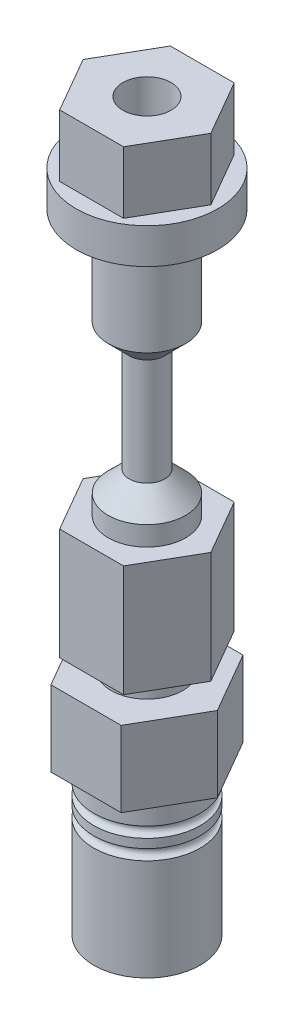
from build123d import *

# Parameters (mm, degrees)
BOSS_EXTRUDE1_DEPTH = 8.89
BOSS_EXTRUDE3_DEPTH = 16.002
BOSS_EXTRUDE4_DEPTH = 10.8458


with BuildPart() as part:
    # Sketch2 → Boss-Extrude1 (new body)
    with BuildSketch(Plane(origin=(0, 0, 0), x_dir=(1, 0, 0), z_dir=(0, 1, 0))):
        Polygon((4.582717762, 7.9375), (-4.582717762, 7.9375), (-9.165435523, 0), (-4.582717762, -7.9375), (4.582717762, -7.9375), (9.165435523, 0), align=None)
    extrude(amount=BOSS_EXTRUDE1_DEPTH)


with BuildPart() as body_2:
    # Sketch3 → Revolve1 (revolve)
    with BuildSketch(Plane.XY, mode=Mode.PRIVATE) as revolve1_sk:
        Polygon((-2.54, -22.06625), (-2.54, -37.36975), (-5.55625, -40.386), (-5.55625, -53.086), (0, -53.086), (0, 0), (-10.16, 0), (-10.16, -5.08), (-4.62661, -5.08), (-4.62661, -7.1628), (-5.55625, -7.1628), (-5.55625, -19.05), align=None)
    revolve(revolve1_sk.sketch.rotate(Axis((0, 0, 0), (0, -1, 0)), 270), axis=Axis((0, 0, 0), (0, -1, 0)))


with BuildPart() as body_3:
    # Sketch5 → Boss-Extrude3 (new body)
    with BuildSketch(Plane.XZ.offset(43.18)):
        Polygon((4.582717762, 7.9375), (-4.582717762, 7.9375), (-9.165435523, 0), (-4.582717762, -7.9375), (4.582717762, -7.9375), (9.165435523, 0), align=None)
    extrude(amount=BOSS_EXTRUDE3_DEPTH)

    # Sketch7 → Revolve2 (revolve)
    with BuildSketch(Plane.XY, mode=Mode.PRIVATE) as revolve2_sk:
        Polygon((-4.809515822, -51.630063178), (-5.1435, -62.357), (0, -62.357), (0, -51.630063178), align=None)
    revolve(revolve2_sk.sketch.rotate(Axis((0, -59.182, 0), (0, -1, 0)), 90), axis=Axis((0, -59.182, 0), (0, -1, 0)))

    # Sketch8 → Boss-Extrude4 (add)
    with BuildSketch(Plane.XZ.offset(62.357)):
        Polygon((5.044655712, 8.7376), (-5.044655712, 8.7376), (-10.089311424, 0), (-5.044655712, -8.7376), (5.044655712, -8.7376), (10.089311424, 0), align=None)
    extrude(amount=BOSS_EXTRUDE4_DEPTH)

    # Sketch9 → Revolve3 (revolve)
    with BuildSketch(Plane.XY, mode=Mode.PRIVATE) as revolve3_sk:
        with BuildLine():
            Line((0, -73.2028), (-7.62, -73.2028))
            Line((-7.62, -73.2028), (-7.62, -76.3778))
            ThreePointArc((-7.62, -76.3778), (-6.858, -77.1398), (-7.62, -77.9018))
            Line((-7.62, -77.9018), (-7.62, -79.1718))
            ThreePointArc((-7.62, -79.1718), (-6.858, -79.9338), (-7.62, -80.6958))
            Line((-7.62, -80.6958), (-7.62, -95.25))
            Line((-7.62, -95.25), (0, -95.25))
            Line((0, -95.25), (0, -73.2028))
        make_face()
    revolve(revolve3_sk.sketch.rotate(Axis((0, -73.2028, 0), (0, -1, 0)), 270), axis=Axis((0, -73.2028, 0), (0, -1, 0)))


with BuildPart() as f_5_16_24_tapped_hole1_tool:
    # Sketch10 → 5_16-24 Tapped Hole1 (revolve)
    with BuildSketch(Plane(origin=(0, 8.89, 0), x_dir=(0, 0, 1), z_dir=(1, 0, 0))):
        Polygon((0, 0), (0, 14.775612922), (3.4544, 12.7), (3.4544, 0), align=None)
    revolve(axis=Axis((0, 15.24, 0), (0, -1, 0)))


with BuildPart() as part_1:
    add(part.part)

    # 5_16-24 Tapped Hole1: cut by f_5_16_24_tapped_hole1_tool
    add(f_5_16_24_tapped_hole1_tool.part, mode=Mode.SUBTRACT)


with BuildPart() as body_2_1:
    add(body_2.part)

    # 5_16-24 Tapped Hole1: cut by f_5_16_24_tapped_hole1_tool
    add(f_5_16_24_tapped_hole1_tool.part, mode=Mode.SUBTRACT)


with BuildPart() as cut_revolve1_tool:
    # Sketch12 → Cut-Revolve1 (revolve)
    with BuildSketch(Plane.XY):
        Polygon((0, 12.225554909), (-3.4544, 12.225554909), (-3.4544, -3.81), (-2.5527, -3.81), (-2.5527, -16.51), (-1.5875, -16.51), (-1.5875, -36.83), (-1.27, -36.83), (-1.27, -53.086), (0, -53.086), align=None)
    revolve(axis=Axis((0, 15.358591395, 0), (0, -1, 0)))


with BuildPart() as body_2_2:
    add(body_2_1.part)

    # Cut-Revolve1: cut by cut_revolve1_tool
    add(cut_revolve1_tool.part, mode=Mode.SUBTRACT)


with BuildPart() as body_3_1:
    add(body_3.part)

    # Cut-Revolve1: cut by cut_revolve1_tool
    add(cut_revolve1_tool.part, mode=Mode.SUBTRACT)


solid = Compound([part_1.part, body_2_2.part, body_3_1.part])
